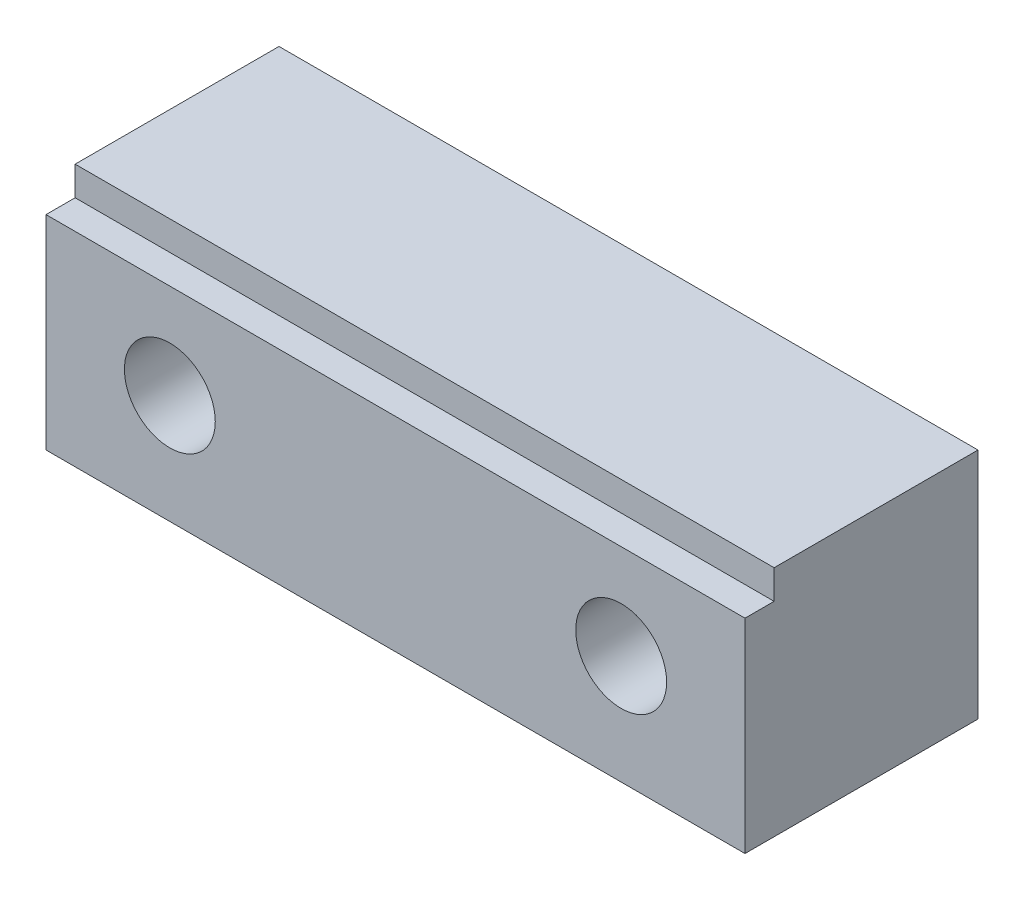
ISO-10303-21;
HEADER;
FILE_DESCRIPTION(('STEP AP214'),'2;1');
FILE_NAME('part.step','',(''),(''),'','','');
FILE_SCHEMA(('AUTOMOTIVE_DESIGN { 1 0 10303 214 1 1 1 1 }'));
ENDSEC;
DATA;
#1=APPLICATION_CONTEXT('core data for automotive mechanical design processes');
#2=APPLICATION_PROTOCOL_DEFINITION('international standard','automotive_design',2000,#1);
#3=PRODUCT_CONTEXT('',#1,'mechanical');
#4=PRODUCT('Part','Part','',(#3));
#5=PRODUCT_RELATED_PRODUCT_CATEGORY('part','',(#4));
#6=PRODUCT_DEFINITION_FORMATION('','',#4);
#7=PRODUCT_DEFINITION_CONTEXT('part definition',#1,'design');
#8=PRODUCT_DEFINITION('design','',#6,#7);
#9=PRODUCT_DEFINITION_SHAPE('','',#8);
#10=(LENGTH_UNIT() NAMED_UNIT(*) SI_UNIT(.MILLI.,.METRE.));
#11=(NAMED_UNIT(*) PLANE_ANGLE_UNIT() SI_UNIT($,.RADIAN.));
#12=(NAMED_UNIT(*) SI_UNIT($,.STERADIAN.) SOLID_ANGLE_UNIT());
#13=UNCERTAINTY_MEASURE_WITH_UNIT(LENGTH_MEASURE(1.E-05),#10,'distance_accuracy_value','');
#14=(GEOMETRIC_REPRESENTATION_CONTEXT(3) GLOBAL_UNCERTAINTY_ASSIGNED_CONTEXT((#13)) GLOBAL_UNIT_ASSIGNED_CONTEXT((#10,
#11,#12)) REPRESENTATION_CONTEXT('',''));
#15=CARTESIAN_POINT('',(0.,0.,0.));
#16=DIRECTION('',(0.,0.,1.));
#17=DIRECTION('',(1.,0.,0.));
#18=AXIS2_PLACEMENT_3D('',#15,#16,#17);
#19=CARTESIAN_POINT('',(76.2,-50.8,-25.4));
#20=DIRECTION('',(1.,0.,0.));
#21=DIRECTION('',(0.,0.,-1.));
#22=AXIS2_PLACEMENT_3D('',#19,#20,#21);
#23=PLANE('',#22);
#24=DIRECTION('',(0.,1.,0.));
#25=VECTOR('',#24,1.);
#26=CARTESIAN_POINT('',(76.2,0.,19.05));
#27=LINE('',#26,#25);
#28=CARTESIAN_POINT('',(76.2,-6.35,19.05));
#29=VERTEX_POINT('',#28);
#30=CARTESIAN_POINT('',(76.2,0.,19.05));
#31=VERTEX_POINT('',#30);
#32=EDGE_CURVE('E54',#29,#31,#27,.T.);
#33=ORIENTED_EDGE('',*,*,#32,.F.);
#34=DIRECTION('',(0.,0.,-1.));
#35=VECTOR('',#34,1.);
#36=CARTESIAN_POINT('',(76.2,-6.35,25.4));
#37=LINE('',#36,#35);
#38=CARTESIAN_POINT('',(76.2,-6.35,25.4));
#39=VERTEX_POINT('',#38);
#40=EDGE_CURVE('E171',#39,#29,#37,.T.);
#41=ORIENTED_EDGE('',*,*,#40,.F.);
#42=DIRECTION('',(0.,1.,0.));
#43=VECTOR('',#42,1.);
#44=CARTESIAN_POINT('',(76.2,-50.8,25.4));
#45=LINE('',#44,#43);
#46=CARTESIAN_POINT('',(76.2,-50.8,25.4));
#47=VERTEX_POINT('',#46);
#48=EDGE_CURVE('E12',#47,#39,#45,.T.);
#49=ORIENTED_EDGE('',*,*,#48,.F.);
#50=DIRECTION('',(0.,0.,-1.));
#51=VECTOR('',#50,1.);
#52=CARTESIAN_POINT('',(76.2,-50.8,-25.4));
#53=LINE('',#52,#51);
#54=CARTESIAN_POINT('',(76.2,-50.8,-25.4));
#55=VERTEX_POINT('',#54);
#56=EDGE_CURVE('E155',#47,#55,#53,.T.);
#57=ORIENTED_EDGE('',*,*,#56,.T.);
#58=DIRECTION('',(0.,1.,0.));
#59=VECTOR('',#58,1.);
#60=CARTESIAN_POINT('',(76.2,-50.8,-25.4));
#61=LINE('',#60,#59);
#62=CARTESIAN_POINT('',(76.2,0.,-25.4));
#63=VERTEX_POINT('',#62);
#64=EDGE_CURVE('E83',#55,#63,#61,.T.);
#65=ORIENTED_EDGE('',*,*,#64,.T.);
#66=DIRECTION('',(0.,0.,-1.));
#67=VECTOR('',#66,1.);
#68=CARTESIAN_POINT('',(76.2,0.,-25.4));
#69=LINE('',#68,#67);
#70=EDGE_CURVE('E150',#31,#63,#69,.T.);
#71=ORIENTED_EDGE('',*,*,#70,.F.);
#72=EDGE_LOOP('',(#33,#41,#49,#57,#65,#71));
#73=FACE_BOUND('',#72,.T.);
#74=ADVANCED_FACE('F38',(#73),#23,.T.);
#75=CARTESIAN_POINT('',(-76.2,-50.8,25.4));
#76=DIRECTION('',(0.,0.,1.));
#77=DIRECTION('',(1.,0.,0.));
#78=AXIS2_PLACEMENT_3D('',#75,#76,#77);
#79=PLANE('',#78);
#80=DIRECTION('',(1.,0.,0.));
#81=VECTOR('',#80,1.);
#82=CARTESIAN_POINT('',(-76.2,-6.35,25.4));
#83=LINE('',#82,#81);
#84=CARTESIAN_POINT('',(-76.2,-6.35,25.4));
#85=VERTEX_POINT('',#84);
#86=EDGE_CURVE('E103',#85,#39,#83,.T.);
#87=ORIENTED_EDGE('',*,*,#86,.F.);
#88=DIRECTION('',(0.,1.,0.));
#89=VECTOR('',#88,1.);
#90=CARTESIAN_POINT('',(-76.2,-50.8,25.4));
#91=LINE('',#90,#89);
#92=CARTESIAN_POINT('',(-76.2,-50.8,25.4));
#93=VERTEX_POINT('',#92);
#94=EDGE_CURVE('E46',#93,#85,#91,.T.);
#95=ORIENTED_EDGE('',*,*,#94,.F.);
#96=DIRECTION('',(1.,0.,0.));
#97=VECTOR('',#96,1.);
#98=CARTESIAN_POINT('',(-76.2,-50.8,25.4));
#99=LINE('',#98,#97);
#100=EDGE_CURVE('E125',#93,#47,#99,.T.);
#101=ORIENTED_EDGE('',*,*,#100,.T.);
#102=ORIENTED_EDGE('',*,*,#48,.T.);
#103=EDGE_LOOP('',(#87,#95,#101,#102));
#104=FACE_BOUND('',#103,.T.);
#105=CARTESIAN_POINT('',(-49.1998,-27.0002,25.4));
#106=DIRECTION('',(0.,0.,1.));
#107=DIRECTION('',(1.,0.,0.));
#108=AXIS2_PLACEMENT_3D('',#105,#106,#107);
#109=CIRCLE('',#108,9.906);
#110=CARTESIAN_POINT('',(-39.2938,-27.0002,25.4));
#111=VERTEX_POINT('',#110);
#112=EDGE_CURVE('E143',#111,#111,#109,.T.);
#113=ORIENTED_EDGE('',*,*,#112,.F.);
#114=EDGE_LOOP('',(#113));
#115=FACE_BOUND('',#114,.T.);
#116=CARTESIAN_POINT('',(49.1998,-27.0002,25.4));
#117=DIRECTION('',(0.,0.,1.));
#118=DIRECTION('',(-1.,0.,0.));
#119=AXIS2_PLACEMENT_3D('',#116,#117,#118);
#120=CIRCLE('',#119,9.906);
#121=CARTESIAN_POINT('',(59.1058,-27.0002,25.4));
#122=VERTEX_POINT('',#121);
#123=EDGE_CURVE('E132',#122,#122,#120,.T.);
#124=ORIENTED_EDGE('',*,*,#123,.F.);
#125=EDGE_LOOP('',(#124));
#126=FACE_BOUND('',#125,.T.);
#127=ADVANCED_FACE('F112',(#104,#115,#126),#79,.T.);
#128=CARTESIAN_POINT('',(-76.2,-50.8,-25.4));
#129=DIRECTION('',(-1.,0.,0.));
#130=DIRECTION('',(0.,0.,1.));
#131=AXIS2_PLACEMENT_3D('',#128,#129,#130);
#132=PLANE('',#131);
#133=DIRECTION('',(0.,1.,0.));
#134=VECTOR('',#133,1.);
#135=CARTESIAN_POINT('',(-76.2,0.,19.05));
#136=LINE('',#135,#134);
#137=CARTESIAN_POINT('',(-76.2,-6.35,19.05));
#138=VERTEX_POINT('',#137);
#139=CARTESIAN_POINT('',(-76.2,0.,19.05));
#140=VERTEX_POINT('',#139);
#141=EDGE_CURVE('E109',#138,#140,#136,.T.);
#142=ORIENTED_EDGE('',*,*,#141,.T.);
#143=DIRECTION('',(0.,0.,1.));
#144=VECTOR('',#143,1.);
#145=CARTESIAN_POINT('',(-76.2,0.,-25.4));
#146=LINE('',#145,#144);
#147=CARTESIAN_POINT('',(-76.2,0.,-25.4));
#148=VERTEX_POINT('',#147);
#149=EDGE_CURVE('E158',#148,#140,#146,.T.);
#150=ORIENTED_EDGE('',*,*,#149,.F.);
#151=DIRECTION('',(0.,1.,0.));
#152=VECTOR('',#151,1.);
#153=CARTESIAN_POINT('',(-76.2,-50.8,-25.4));
#154=LINE('',#153,#152);
#155=CARTESIAN_POINT('',(-76.2,-50.8,-25.4));
#156=VERTEX_POINT('',#155);
#157=EDGE_CURVE('E78',#156,#148,#154,.T.);
#158=ORIENTED_EDGE('',*,*,#157,.F.);
#159=DIRECTION('',(0.,0.,1.));
#160=VECTOR('',#159,1.);
#161=CARTESIAN_POINT('',(-76.2,-50.8,-25.4));
#162=LINE('',#161,#160);
#163=EDGE_CURVE('E119',#156,#93,#162,.T.);
#164=ORIENTED_EDGE('',*,*,#163,.T.);
#165=ORIENTED_EDGE('',*,*,#94,.T.);
#166=DIRECTION('',(0.,0.,-1.));
#167=VECTOR('',#166,1.);
#168=CARTESIAN_POINT('',(-76.2,-6.35,25.4));
#169=LINE('',#168,#167);
#170=EDGE_CURVE('E99',#85,#138,#169,.T.);
#171=ORIENTED_EDGE('',*,*,#170,.T.);
#172=EDGE_LOOP('',(#142,#150,#158,#164,#165,#171));
#173=FACE_BOUND('',#172,.T.);
#174=ADVANCED_FACE('F117',(#173),#132,.T.);
#175=CARTESIAN_POINT('',(-76.2,-50.8,-25.4));
#176=DIRECTION('',(0.,0.,-1.));
#177=DIRECTION('',(-1.,0.,0.));
#178=AXIS2_PLACEMENT_3D('',#175,#176,#177);
#179=PLANE('',#178);
#180=CARTESIAN_POINT('',(-49.1998,-27.0002,-25.4));
#181=DIRECTION('',(0.,0.,1.));
#182=DIRECTION('',(1.,0.,0.));
#183=AXIS2_PLACEMENT_3D('',#180,#181,#182);
#184=CIRCLE('',#183,6.7437);
#185=CARTESIAN_POINT('',(-42.4561,-27.0002,-25.4));
#186=VERTEX_POINT('',#185);
#187=EDGE_CURVE('E128',#186,#186,#184,.T.);
#188=ORIENTED_EDGE('',*,*,#187,.T.);
#189=EDGE_LOOP('',(#188));
#190=FACE_BOUND('',#189,.T.);
#191=CARTESIAN_POINT('',(49.1998,-27.0002,-25.4));
#192=DIRECTION('',(0.,0.,1.));
#193=DIRECTION('',(1.,0.,0.));
#194=AXIS2_PLACEMENT_3D('',#191,#192,#193);
#195=CIRCLE('',#194,6.7437);
#196=CARTESIAN_POINT('',(55.9435,-27.0002,-25.4));
#197=VERTEX_POINT('',#196);
#198=EDGE_CURVE('E134',#197,#197,#195,.T.);
#199=ORIENTED_EDGE('',*,*,#198,.T.);
#200=EDGE_LOOP('',(#199));
#201=FACE_BOUND('',#200,.T.);
#202=DIRECTION('',(-1.,0.,0.));
#203=VECTOR('',#202,1.);
#204=CARTESIAN_POINT('',(-76.2,0.,-25.4));
#205=LINE('',#204,#203);
#206=EDGE_CURVE('E163',#63,#148,#205,.T.);
#207=ORIENTED_EDGE('',*,*,#206,.F.);
#208=ORIENTED_EDGE('',*,*,#64,.F.);
#209=DIRECTION('',(-1.,0.,0.));
#210=VECTOR('',#209,1.);
#211=CARTESIAN_POINT('',(-76.2,-50.8,-25.4));
#212=LINE('',#211,#210);
#213=EDGE_CURVE('E157',#55,#156,#212,.T.);
#214=ORIENTED_EDGE('',*,*,#213,.T.);
#215=ORIENTED_EDGE('',*,*,#157,.T.);
#216=EDGE_LOOP('',(#207,#208,#214,#215));
#217=FACE_BOUND('',#216,.T.);
#218=ADVANCED_FACE('F175',(#190,#201,#217),#179,.T.);
#219=CARTESIAN_POINT('',(0.,-50.8,0.));
#220=DIRECTION('',(0.,1.,0.));
#221=DIRECTION('',(0.,0.,1.));
#222=AXIS2_PLACEMENT_3D('',#219,#220,#221);
#223=PLANE('',#222);
#224=ORIENTED_EDGE('',*,*,#56,.F.);
#225=ORIENTED_EDGE('',*,*,#100,.F.);
#226=ORIENTED_EDGE('',*,*,#163,.F.);
#227=ORIENTED_EDGE('',*,*,#213,.F.);
#228=EDGE_LOOP('',(#224,#225,#226,#227));
#229=FACE_BOUND('',#228,.T.);
#230=ADVANCED_FACE('F177',(#229),#223,.F.);
#231=CARTESIAN_POINT('',(0.,0.,0.));
#232=DIRECTION('',(0.,1.,0.));
#233=DIRECTION('',(0.,0.,1.));
#234=AXIS2_PLACEMENT_3D('',#231,#232,#233);
#235=PLANE('',#234);
#236=DIRECTION('',(1.,0.,0.));
#237=VECTOR('',#236,1.);
#238=CARTESIAN_POINT('',(-76.2,0.,19.05));
#239=LINE('',#238,#237);
#240=EDGE_CURVE('E139',#140,#31,#239,.T.);
#241=ORIENTED_EDGE('',*,*,#240,.T.);
#242=ORIENTED_EDGE('',*,*,#70,.T.);
#243=ORIENTED_EDGE('',*,*,#206,.T.);
#244=ORIENTED_EDGE('',*,*,#149,.T.);
#245=EDGE_LOOP('',(#241,#242,#243,#244));
#246=FACE_BOUND('',#245,.T.);
#247=ADVANCED_FACE('F167',(#246),#235,.T.);
#248=CARTESIAN_POINT('',(-76.2,-50.8,-16.002));
#249=DIRECTION('',(0.,0.,-1.));
#250=DIRECTION('',(-1.,0.,0.));
#251=AXIS2_PLACEMENT_3D('',#248,#249,#250);
#252=PLANE('',#251);
#253=CARTESIAN_POINT('',(49.1998,-27.0002,-16.002));
#254=DIRECTION('',(0.,0.,-1.));
#255=DIRECTION('',(-1.,0.,0.));
#256=AXIS2_PLACEMENT_3D('',#253,#254,#255);
#257=CIRCLE('',#256,6.7437);
#258=CARTESIAN_POINT('',(42.4561,-27.0002,-16.002));
#259=VERTEX_POINT('',#258);
#260=EDGE_CURVE('E41',#259,#259,#257,.T.);
#261=ORIENTED_EDGE('',*,*,#260,.T.);
#262=EDGE_LOOP('',(#261));
#263=FACE_BOUND('',#262,.T.);
#264=CARTESIAN_POINT('',(49.1998,-27.0002,-16.002));
#265=DIRECTION('',(0.,0.,-1.));
#266=DIRECTION('',(-1.,0.,0.));
#267=AXIS2_PLACEMENT_3D('',#264,#265,#266);
#268=CIRCLE('',#267,9.906);
#269=CARTESIAN_POINT('',(59.1058,-27.0002,-16.002));
#270=VERTEX_POINT('',#269);
#271=EDGE_CURVE('E147',#270,#270,#268,.F.);
#272=ORIENTED_EDGE('',*,*,#271,.T.);
#273=EDGE_LOOP('',(#272));
#274=FACE_BOUND('',#273,.T.);
#275=ADVANCED_FACE('F195',(#263,#274),#252,.F.);
#276=CARTESIAN_POINT('',(49.1998,-27.0002,-53.4183990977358));
#277=DIRECTION('',(0.,0.,1.));
#278=DIRECTION('',(1.,0.,0.));
#279=AXIS2_PLACEMENT_3D('',#276,#277,#278);
#280=CYLINDRICAL_SURFACE('',#279,9.906);
#281=CARTESIAN_POINT('',(59.1058,-27.0002,25.4));
#282=CARTESIAN_POINT('',(59.1058,-27.0002,24.9687291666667));
#283=CARTESIAN_POINT('',(59.1058,-27.0002,24.5374583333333));
#284=CARTESIAN_POINT('',(59.1058,-27.0002,23.6749166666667));
#285=CARTESIAN_POINT('',(59.1058,-27.0002,23.2436458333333));
#286=CARTESIAN_POINT('',(59.1058,-27.0002,22.3811041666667));
#287=CARTESIAN_POINT('',(59.1058,-27.0002,21.9498333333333));
#288=CARTESIAN_POINT('',(59.1058,-27.0002,21.0872916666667));
#289=CARTESIAN_POINT('',(59.1058,-27.0002,20.6560208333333));
#290=CARTESIAN_POINT('',(59.1058,-27.0002,19.7934791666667));
#291=CARTESIAN_POINT('',(59.1058,-27.0002,19.3622083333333));
#292=CARTESIAN_POINT('',(59.1058,-27.0002,18.4996666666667));
#293=CARTESIAN_POINT('',(59.1058,-27.0002,18.0683958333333));
#294=CARTESIAN_POINT('',(59.1058,-27.0002,17.2058541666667));
#295=CARTESIAN_POINT('',(59.1058,-27.0002,16.7745833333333));
#296=CARTESIAN_POINT('',(59.1058,-27.0002,15.9120416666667));
#297=CARTESIAN_POINT('',(59.1058,-27.0002,15.4807708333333));
#298=CARTESIAN_POINT('',(59.1058,-27.0002,14.6182291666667));
#299=CARTESIAN_POINT('',(59.1058,-27.0002,14.1869583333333));
#300=CARTESIAN_POINT('',(59.1058,-27.0002,13.3244166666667));
#301=CARTESIAN_POINT('',(59.1058,-27.0002,12.8931458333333));
#302=CARTESIAN_POINT('',(59.1058,-27.0002,12.0306041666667));
#303=CARTESIAN_POINT('',(59.1058,-27.0002,11.5993333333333));
#304=CARTESIAN_POINT('',(59.1058,-27.0002,10.7367916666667));
#305=CARTESIAN_POINT('',(59.1058,-27.0002,10.3055208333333));
#306=CARTESIAN_POINT('',(59.1058,-27.0002,9.44297916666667));
#307=CARTESIAN_POINT('',(59.1058,-27.0002,9.01170833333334));
#308=CARTESIAN_POINT('',(59.1058,-27.0002,8.14916666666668));
#309=CARTESIAN_POINT('',(59.1058,-27.0002,7.71789583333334));
#310=CARTESIAN_POINT('',(59.1058,-27.0002,6.85535416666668));
#311=CARTESIAN_POINT('',(59.1058,-27.0002,6.42408333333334));
#312=CARTESIAN_POINT('',(59.1058,-27.0002,5.56154166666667));
#313=CARTESIAN_POINT('',(59.1058,-27.0002,5.13027083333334));
#314=CARTESIAN_POINT('',(59.1058,-27.0002,4.26772916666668));
#315=CARTESIAN_POINT('',(59.1058,-27.0002,3.83645833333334));
#316=CARTESIAN_POINT('',(59.1058,-27.0002,2.97391666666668));
#317=CARTESIAN_POINT('',(59.1058,-27.0002,2.54264583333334));
#318=CARTESIAN_POINT('',(59.1058,-27.0002,1.68010416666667));
#319=CARTESIAN_POINT('',(59.1058,-27.0002,1.24883333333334));
#320=CARTESIAN_POINT('',(59.1058,-27.0002,0.386291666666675));
#321=CARTESIAN_POINT('',(59.1058,-27.0002,-0.0449791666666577));
#322=CARTESIAN_POINT('',(59.1058,-27.0002,-0.907520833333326));
#323=CARTESIAN_POINT('',(59.1058,-27.0002,-1.33879166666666));
#324=CARTESIAN_POINT('',(59.1058,-27.0002,-2.20133333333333));
#325=CARTESIAN_POINT('',(59.1058,-27.0002,-2.63260416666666));
#326=CARTESIAN_POINT('',(59.1058,-27.0002,-3.49514583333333));
#327=CARTESIAN_POINT('',(59.1058,-27.0002,-3.92641666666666));
#328=CARTESIAN_POINT('',(59.1058,-27.0002,-4.78895833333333));
#329=CARTESIAN_POINT('',(59.1058,-27.0002,-5.22022916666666));
#330=CARTESIAN_POINT('',(59.1058,-27.0002,-6.08277083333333));
#331=CARTESIAN_POINT('',(59.1058,-27.0002,-6.51404166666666));
#332=CARTESIAN_POINT('',(59.1058,-27.0002,-7.37658333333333));
#333=CARTESIAN_POINT('',(59.1058,-27.0002,-7.80785416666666));
#334=CARTESIAN_POINT('',(59.1058,-27.0002,-8.67039583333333));
#335=CARTESIAN_POINT('',(59.1058,-27.0002,-9.10166666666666));
#336=CARTESIAN_POINT('',(59.1058,-27.0002,-9.96420833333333));
#337=CARTESIAN_POINT('',(59.1058,-27.0002,-10.3954791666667));
#338=CARTESIAN_POINT('',(59.1058,-27.0002,-11.2580208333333));
#339=CARTESIAN_POINT('',(59.1058,-27.0002,-11.6892916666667));
#340=CARTESIAN_POINT('',(59.1058,-27.0002,-12.5518333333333));
#341=CARTESIAN_POINT('',(59.1058,-27.0002,-12.9831041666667));
#342=CARTESIAN_POINT('',(59.1058,-27.0002,-13.8456458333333));
#343=CARTESIAN_POINT('',(59.1058,-27.0002,-14.2769166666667));
#344=CARTESIAN_POINT('',(59.1058,-27.0002,-15.1394583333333));
#345=CARTESIAN_POINT('',(59.1058,-27.0002,-15.5707291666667));
#346=CARTESIAN_POINT('',(59.1058,-27.0002,-16.002));
#347=B_SPLINE_CURVE_WITH_KNOTS('',3,(#281,#282,#283,#284,#285,#286,#287,#288,#289,#290,#291,
#292,#293,#294,#295,#296,#297,#298,#299,#300,#301,#302,#303,#304,#305,#306,#307,#308,#309,#310,
#311,#312,#313,#314,#315,#316,#317,#318,#319,#320,#321,#322,#323,#324,#325,#326,#327,#328,#329,
#330,#331,#332,#333,#334,#335,#336,#337,#338,#339,#340,#341,#342,#343,#344,#345,#346),
.UNSPECIFIED.,.F.,.F.,(4,2,2,2,2,2,2,2,2,2,2,2,2,2,2,2,2,2,2,2,2,2,2,2,2,2,2,2,2,2,2,2,4),(0.,
1.2938125,2.587625,3.8814375,5.17525000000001,6.4690625,7.762875,9.05668750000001,10.3505,
11.6443125,12.938125,14.2319375,15.52575,16.8195625,18.113375,19.4071875,20.701,21.9948125,
23.288625,24.5824375,25.87625,27.1700625,28.463875,29.7576875,31.0515,32.3453125,33.639125,
34.9329375,36.22675,37.5205625,38.814375,40.1081875,41.402),.UNSPECIFIED.);
#348=EDGE_CURVE('BSEAM199',#122,#270,#347,.T.);
#349=ORIENTED_EDGE('',*,*,#123,.T.);
#350=ORIENTED_EDGE('',*,*,#271,.F.);
#351=ORIENTED_EDGE('',*,*,#348,.T.);
#352=ORIENTED_EDGE('',*,*,#348,.F.);
#353=EDGE_LOOP('',(#349,#351,#350,#352));
#354=FACE_BOUND('',#353,.T.);
#355=ADVANCED_FACE('F199',(#354),#280,.F.);
#356=CARTESIAN_POINT('',(-76.2,-50.8,-16.002));
#357=DIRECTION('',(0.,0.,-1.));
#358=DIRECTION('',(-1.,0.,0.));
#359=AXIS2_PLACEMENT_3D('',#356,#357,#358);
#360=PLANE('',#359);
#361=CARTESIAN_POINT('',(-49.1998,-27.0002,-16.002));
#362=DIRECTION('',(0.,0.,-1.));
#363=DIRECTION('',(-1.,0.,0.));
#364=AXIS2_PLACEMENT_3D('',#361,#362,#363);
#365=CIRCLE('',#364,6.7437);
#366=CARTESIAN_POINT('',(-55.9435,-27.0002,-16.002));
#367=VERTEX_POINT('',#366);
#368=EDGE_CURVE('E126',#367,#367,#365,.T.);
#369=ORIENTED_EDGE('',*,*,#368,.T.);
#370=EDGE_LOOP('',(#369));
#371=FACE_BOUND('',#370,.T.);
#372=CARTESIAN_POINT('',(-49.1998,-27.0002,-16.002));
#373=DIRECTION('',(0.,0.,-1.));
#374=DIRECTION('',(-1.,0.,0.));
#375=AXIS2_PLACEMENT_3D('',#372,#373,#374);
#376=CIRCLE('',#375,9.906);
#377=CARTESIAN_POINT('',(-39.2938,-27.0002,-16.002));
#378=VERTEX_POINT('',#377);
#379=EDGE_CURVE('E146',#378,#378,#376,.F.);
#380=ORIENTED_EDGE('',*,*,#379,.T.);
#381=EDGE_LOOP('',(#380));
#382=FACE_BOUND('',#381,.T.);
#383=ADVANCED_FACE('F203',(#371,#382),#360,.F.);
#384=CARTESIAN_POINT('',(-49.1998,-27.0002,-53.4183990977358));
#385=DIRECTION('',(0.,0.,1.));
#386=DIRECTION('',(1.,0.,0.));
#387=AXIS2_PLACEMENT_3D('',#384,#385,#386);
#388=CYLINDRICAL_SURFACE('',#387,9.906);
#389=CARTESIAN_POINT('',(-39.2938,-27.0002,25.4));
#390=CARTESIAN_POINT('',(-39.2938,-27.0002,24.9687291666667));
#391=CARTESIAN_POINT('',(-39.2938,-27.0002,24.5374583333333));
#392=CARTESIAN_POINT('',(-39.2938,-27.0002,23.6749166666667));
#393=CARTESIAN_POINT('',(-39.2938,-27.0002,23.2436458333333));
#394=CARTESIAN_POINT('',(-39.2938,-27.0002,22.3811041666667));
#395=CARTESIAN_POINT('',(-39.2938,-27.0002,21.9498333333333));
#396=CARTESIAN_POINT('',(-39.2938,-27.0002,21.0872916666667));
#397=CARTESIAN_POINT('',(-39.2938,-27.0002,20.6560208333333));
#398=CARTESIAN_POINT('',(-39.2938,-27.0002,19.7934791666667));
#399=CARTESIAN_POINT('',(-39.2938,-27.0002,19.3622083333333));
#400=CARTESIAN_POINT('',(-39.2938,-27.0002,18.4996666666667));
#401=CARTESIAN_POINT('',(-39.2938,-27.0002,18.0683958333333));
#402=CARTESIAN_POINT('',(-39.2938,-27.0002,17.2058541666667));
#403=CARTESIAN_POINT('',(-39.2938,-27.0002,16.7745833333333));
#404=CARTESIAN_POINT('',(-39.2938,-27.0002,15.9120416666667));
#405=CARTESIAN_POINT('',(-39.2938,-27.0002,15.4807708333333));
#406=CARTESIAN_POINT('',(-39.2938,-27.0002,14.6182291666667));
#407=CARTESIAN_POINT('',(-39.2938,-27.0002,14.1869583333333));
#408=CARTESIAN_POINT('',(-39.2938,-27.0002,13.3244166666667));
#409=CARTESIAN_POINT('',(-39.2938,-27.0002,12.8931458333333));
#410=CARTESIAN_POINT('',(-39.2938,-27.0002,12.0306041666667));
#411=CARTESIAN_POINT('',(-39.2938,-27.0002,11.5993333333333));
#412=CARTESIAN_POINT('',(-39.2938,-27.0002,10.7367916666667));
#413=CARTESIAN_POINT('',(-39.2938,-27.0002,10.3055208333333));
#414=CARTESIAN_POINT('',(-39.2938,-27.0002,9.44297916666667));
#415=CARTESIAN_POINT('',(-39.2938,-27.0002,9.01170833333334));
#416=CARTESIAN_POINT('',(-39.2938,-27.0002,8.14916666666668));
#417=CARTESIAN_POINT('',(-39.2938,-27.0002,7.71789583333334));
#418=CARTESIAN_POINT('',(-39.2938,-27.0002,6.85535416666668));
#419=CARTESIAN_POINT('',(-39.2938,-27.0002,6.42408333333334));
#420=CARTESIAN_POINT('',(-39.2938,-27.0002,5.56154166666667));
#421=CARTESIAN_POINT('',(-39.2938,-27.0002,5.13027083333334));
#422=CARTESIAN_POINT('',(-39.2938,-27.0002,4.26772916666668));
#423=CARTESIAN_POINT('',(-39.2938,-27.0002,3.83645833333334));
#424=CARTESIAN_POINT('',(-39.2938,-27.0002,2.97391666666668));
#425=CARTESIAN_POINT('',(-39.2938,-27.0002,2.54264583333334));
#426=CARTESIAN_POINT('',(-39.2938,-27.0002,1.68010416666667));
#427=CARTESIAN_POINT('',(-39.2938,-27.0002,1.24883333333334));
#428=CARTESIAN_POINT('',(-39.2938,-27.0002,0.386291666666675));
#429=CARTESIAN_POINT('',(-39.2938,-27.0002,-0.0449791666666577));
#430=CARTESIAN_POINT('',(-39.2938,-27.0002,-0.907520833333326));
#431=CARTESIAN_POINT('',(-39.2938,-27.0002,-1.33879166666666));
#432=CARTESIAN_POINT('',(-39.2938,-27.0002,-2.20133333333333));
#433=CARTESIAN_POINT('',(-39.2938,-27.0002,-2.63260416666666));
#434=CARTESIAN_POINT('',(-39.2938,-27.0002,-3.49514583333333));
#435=CARTESIAN_POINT('',(-39.2938,-27.0002,-3.92641666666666));
#436=CARTESIAN_POINT('',(-39.2938,-27.0002,-4.78895833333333));
#437=CARTESIAN_POINT('',(-39.2938,-27.0002,-5.22022916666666));
#438=CARTESIAN_POINT('',(-39.2938,-27.0002,-6.08277083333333));
#439=CARTESIAN_POINT('',(-39.2938,-27.0002,-6.51404166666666));
#440=CARTESIAN_POINT('',(-39.2938,-27.0002,-7.37658333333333));
#441=CARTESIAN_POINT('',(-39.2938,-27.0002,-7.80785416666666));
#442=CARTESIAN_POINT('',(-39.2938,-27.0002,-8.67039583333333));
#443=CARTESIAN_POINT('',(-39.2938,-27.0002,-9.10166666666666));
#444=CARTESIAN_POINT('',(-39.2938,-27.0002,-9.96420833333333));
#445=CARTESIAN_POINT('',(-39.2938,-27.0002,-10.3954791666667));
#446=CARTESIAN_POINT('',(-39.2938,-27.0002,-11.2580208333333));
#447=CARTESIAN_POINT('',(-39.2938,-27.0002,-11.6892916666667));
#448=CARTESIAN_POINT('',(-39.2938,-27.0002,-12.5518333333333));
#449=CARTESIAN_POINT('',(-39.2938,-27.0002,-12.9831041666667));
#450=CARTESIAN_POINT('',(-39.2938,-27.0002,-13.8456458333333));
#451=CARTESIAN_POINT('',(-39.2938,-27.0002,-14.2769166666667));
#452=CARTESIAN_POINT('',(-39.2938,-27.0002,-15.1394583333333));
#453=CARTESIAN_POINT('',(-39.2938,-27.0002,-15.5707291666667));
#454=CARTESIAN_POINT('',(-39.2938,-27.0002,-16.002));
#455=B_SPLINE_CURVE_WITH_KNOTS('',3,(#389,#390,#391,#392,#393,#394,#395,#396,#397,#398,#399,
#400,#401,#402,#403,#404,#405,#406,#407,#408,#409,#410,#411,#412,#413,#414,#415,#416,#417,#418,
#419,#420,#421,#422,#423,#424,#425,#426,#427,#428,#429,#430,#431,#432,#433,#434,#435,#436,#437,
#438,#439,#440,#441,#442,#443,#444,#445,#446,#447,#448,#449,#450,#451,#452,#453,#454),
.UNSPECIFIED.,.F.,.F.,(4,2,2,2,2,2,2,2,2,2,2,2,2,2,2,2,2,2,2,2,2,2,2,2,2,2,2,2,2,2,2,2,4),(0.,
1.2938125,2.587625,3.8814375,5.17525000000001,6.4690625,7.762875,9.05668750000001,10.3505,
11.6443125,12.938125,14.2319375,15.52575,16.8195625,18.113375,19.4071875,20.701,21.9948125,
23.288625,24.5824375,25.87625,27.1700625,28.463875,29.7576875,31.0515,32.3453125,33.639125,
34.9329375,36.22675,37.5205625,38.814375,40.1081875,41.402),.UNSPECIFIED.);
#456=EDGE_CURVE('BSEAM207',#111,#378,#455,.T.);
#457=ORIENTED_EDGE('',*,*,#112,.T.);
#458=ORIENTED_EDGE('',*,*,#379,.F.);
#459=ORIENTED_EDGE('',*,*,#456,.T.);
#460=ORIENTED_EDGE('',*,*,#456,.F.);
#461=EDGE_LOOP('',(#457,#459,#458,#460));
#462=FACE_BOUND('',#461,.T.);
#463=ADVANCED_FACE('F207',(#462),#388,.F.);
#464=CARTESIAN_POINT('',(-49.1998,-27.0002,-25.4));
#465=DIRECTION('',(0.,0.,1.));
#466=DIRECTION('',(1.,0.,0.));
#467=AXIS2_PLACEMENT_3D('',#464,#465,#466);
#468=CYLINDRICAL_SURFACE('',#467,6.7437);
#469=ORIENTED_EDGE('',*,*,#187,.F.);
#470=EDGE_LOOP('',(#469));
#471=FACE_BOUND('',#470,.T.);
#472=ORIENTED_EDGE('',*,*,#368,.F.);
#473=EDGE_LOOP('',(#472));
#474=FACE_BOUND('',#473,.T.);
#475=ADVANCED_FACE('F210',(#471,#474),#468,.F.);
#476=CARTESIAN_POINT('',(49.1998,-27.0002,-25.4));
#477=DIRECTION('',(0.,0.,1.));
#478=DIRECTION('',(1.,0.,0.));
#479=AXIS2_PLACEMENT_3D('',#476,#477,#478);
#480=CYLINDRICAL_SURFACE('',#479,6.7437);
#481=ORIENTED_EDGE('',*,*,#198,.F.);
#482=EDGE_LOOP('',(#481));
#483=FACE_BOUND('',#482,.T.);
#484=ORIENTED_EDGE('',*,*,#260,.F.);
#485=EDGE_LOOP('',(#484));
#486=FACE_BOUND('',#485,.T.);
#487=ADVANCED_FACE('F212',(#483,#486),#480,.F.);
#488=CARTESIAN_POINT('',(-76.2,0.,19.05));
#489=DIRECTION('',(0.,0.,-1.));
#490=DIRECTION('',(-1.,0.,0.));
#491=AXIS2_PLACEMENT_3D('',#488,#489,#490);
#492=PLANE('',#491);
#493=ORIENTED_EDGE('',*,*,#32,.T.);
#494=ORIENTED_EDGE('',*,*,#240,.F.);
#495=ORIENTED_EDGE('',*,*,#141,.F.);
#496=DIRECTION('',(1.,0.,0.));
#497=VECTOR('',#496,1.);
#498=CARTESIAN_POINT('',(-76.2,-6.35,19.05));
#499=LINE('',#498,#497);
#500=EDGE_CURVE('E104',#138,#29,#499,.T.);
#501=ORIENTED_EDGE('',*,*,#500,.T.);
#502=EDGE_LOOP('',(#493,#494,#495,#501));
#503=FACE_BOUND('',#502,.T.);
#504=ADVANCED_FACE('F174',(#503),#492,.F.);
#505=CARTESIAN_POINT('',(-76.2,-6.35,25.4));
#506=DIRECTION('',(0.,-1.,0.));
#507=DIRECTION('',(0.,0.,-1.));
#508=AXIS2_PLACEMENT_3D('',#505,#506,#507);
#509=PLANE('',#508);
#510=ORIENTED_EDGE('',*,*,#40,.T.);
#511=ORIENTED_EDGE('',*,*,#500,.F.);
#512=ORIENTED_EDGE('',*,*,#170,.F.);
#513=ORIENTED_EDGE('',*,*,#86,.T.);
#514=EDGE_LOOP('',(#510,#511,#512,#513));
#515=FACE_BOUND('',#514,.T.);
#516=ADVANCED_FACE('F102',(#515),#509,.F.);
#517=CLOSED_SHELL('',(#74,#127,#174,#218,#230,#247,#275,#355,#383,#463,#475,#487,#504,#516));
#518=MANIFOLD_SOLID_BREP('B2',#517);
#519=ADVANCED_BREP_SHAPE_REPRESENTATION('',(#18,#518),#14);
#520=SHAPE_DEFINITION_REPRESENTATION(#9,#519);
ENDSEC;
END-ISO-10303-21;
